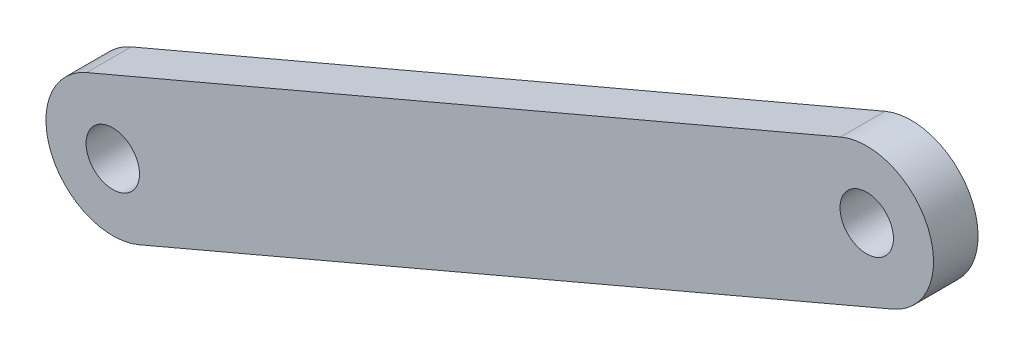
ISO-10303-21;
HEADER;
FILE_DESCRIPTION(('STEP AP214'),'2;1');
FILE_NAME('part.step','',(''),(''),'','','');
FILE_SCHEMA(('AUTOMOTIVE_DESIGN { 1 0 10303 214 1 1 1 1 }'));
ENDSEC;
DATA;
#1=APPLICATION_CONTEXT('core data for automotive mechanical design processes');
#2=APPLICATION_PROTOCOL_DEFINITION('international standard','automotive_design',2000,#1);
#3=PRODUCT_CONTEXT('',#1,'mechanical');
#4=PRODUCT('Part','Part','',(#3));
#5=PRODUCT_RELATED_PRODUCT_CATEGORY('part','',(#4));
#6=PRODUCT_DEFINITION_FORMATION('','',#4);
#7=PRODUCT_DEFINITION_CONTEXT('part definition',#1,'design');
#8=PRODUCT_DEFINITION('design','',#6,#7);
#9=PRODUCT_DEFINITION_SHAPE('','',#8);
#10=(LENGTH_UNIT() NAMED_UNIT(*) SI_UNIT(.MILLI.,.METRE.));
#11=(NAMED_UNIT(*) PLANE_ANGLE_UNIT() SI_UNIT($,.RADIAN.));
#12=(NAMED_UNIT(*) SI_UNIT($,.STERADIAN.) SOLID_ANGLE_UNIT());
#13=UNCERTAINTY_MEASURE_WITH_UNIT(LENGTH_MEASURE(1.E-05),#10,'distance_accuracy_value','');
#14=(GEOMETRIC_REPRESENTATION_CONTEXT(3) GLOBAL_UNCERTAINTY_ASSIGNED_CONTEXT((#13)) GLOBAL_UNIT_ASSIGNED_CONTEXT((#10,
#11,#12)) REPRESENTATION_CONTEXT('',''));
#15=CARTESIAN_POINT('',(0.,0.,0.));
#16=DIRECTION('',(0.,0.,1.));
#17=DIRECTION('',(1.,0.,0.));
#18=AXIS2_PLACEMENT_3D('',#15,#16,#17);
#19=CARTESIAN_POINT('',(0.,-20.,-5.));
#20=DIRECTION('',(0.,0.,-1.));
#21=DIRECTION('',(-1.,0.,0.));
#22=AXIS2_PLACEMENT_3D('',#19,#20,#21);
#23=CYLINDRICAL_SURFACE('',#22,7.50000000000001);
#24=CARTESIAN_POINT('',(0.,-20.,-10.));
#25=DIRECTION('',(0.,0.,1.));
#26=DIRECTION('',(1.,0.,0.));
#27=AXIS2_PLACEMENT_3D('',#24,#25,#26);
#28=CIRCLE('',#27,7.50000000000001);
#29=CARTESIAN_POINT('',(2.93949354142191,-26.8999549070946,-10.));
#30=VERTEX_POINT('',#29);
#31=CARTESIAN_POINT('',(-2.9394935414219,-13.1000450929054,-10.));
#32=VERTEX_POINT('',#31);
#33=EDGE_CURVE('E100',#30,#32,#28,.T.);
#34=ORIENTED_EDGE('',*,*,#33,.T.);
#35=DIRECTION('',(0.,0.,-1.));
#36=VECTOR('',#35,1.);
#37=CARTESIAN_POINT('',(-2.9394935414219,-13.1000450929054,-5.));
#38=LINE('',#37,#36);
#39=CARTESIAN_POINT('',(-2.9394935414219,-13.1000450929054,-5.));
#40=VERTEX_POINT('',#39);
#41=EDGE_CURVE('E11',#40,#32,#38,.T.);
#42=ORIENTED_EDGE('',*,*,#41,.F.);
#43=CARTESIAN_POINT('',(0.,-20.,-5.));
#44=DIRECTION('',(0.,0.,1.));
#45=DIRECTION('',(1.,0.,0.));
#46=AXIS2_PLACEMENT_3D('',#43,#44,#45);
#47=CIRCLE('',#46,7.50000000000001);
#48=CARTESIAN_POINT('',(2.93949354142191,-26.8999549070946,-5.));
#49=VERTEX_POINT('',#48);
#50=EDGE_CURVE('E88',#49,#40,#47,.T.);
#51=ORIENTED_EDGE('',*,*,#50,.F.);
#52=DIRECTION('',(0.,0.,-1.));
#53=VECTOR('',#52,1.);
#54=CARTESIAN_POINT('',(2.93949354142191,-26.8999549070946,-5.));
#55=LINE('',#54,#53);
#56=EDGE_CURVE('E96',#49,#30,#55,.T.);
#57=ORIENTED_EDGE('',*,*,#56,.T.);
#58=EDGE_LOOP('',(#34,#42,#51,#57));
#59=FACE_BOUND('',#58,.T.);
#60=ADVANCED_FACE('F37',(#59),#23,.T.);
#61=CARTESIAN_POINT('',(-2.9394935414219,-13.1000450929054,-5.));
#62=DIRECTION('',(0.391932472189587,-0.919993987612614,0.));
#63=DIRECTION('',(0.919993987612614,0.391932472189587,0.));
#64=AXIS2_PLACEMENT_3D('',#61,#62,#63);
#65=PLANE('',#64);
#66=DIRECTION('',(-0.919993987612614,-0.391932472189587,0.));
#67=VECTOR('',#66,1.);
#68=CARTESIAN_POINT('',(-2.9394935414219,-13.1000450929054,-10.));
#69=LINE('',#68,#67);
#70=CARTESIAN_POINT('',(-87.5789404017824,-49.1578325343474,-10.));
#71=VERTEX_POINT('',#70);
#72=EDGE_CURVE('E92',#32,#71,#69,.T.);
#73=ORIENTED_EDGE('',*,*,#72,.T.);
#74=DIRECTION('',(0.,0.,-1.));
#75=VECTOR('',#74,1.);
#76=CARTESIAN_POINT('',(-87.5789404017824,-49.1578325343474,-5.));
#77=LINE('',#76,#75);
#78=CARTESIAN_POINT('',(-87.5789404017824,-49.1578325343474,-5.));
#79=VERTEX_POINT('',#78);
#80=EDGE_CURVE('E45',#79,#71,#77,.T.);
#81=ORIENTED_EDGE('',*,*,#80,.F.);
#82=DIRECTION('',(-0.919993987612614,-0.391932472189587,0.));
#83=VECTOR('',#82,1.);
#84=CARTESIAN_POINT('',(-2.9394935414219,-13.1000450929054,-5.));
#85=LINE('',#84,#83);
#86=EDGE_CURVE('E83',#40,#79,#85,.T.);
#87=ORIENTED_EDGE('',*,*,#86,.F.);
#88=ORIENTED_EDGE('',*,*,#41,.T.);
#89=EDGE_LOOP('',(#73,#81,#87,#88));
#90=FACE_BOUND('',#89,.T.);
#91=ADVANCED_FACE('F91',(#90),#65,.F.);
#92=CARTESIAN_POINT('',(-84.6394468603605,-56.057787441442,-5.));
#93=DIRECTION('',(0.,0.,-1.));
#94=DIRECTION('',(-1.,0.,0.));
#95=AXIS2_PLACEMENT_3D('',#92,#93,#94);
#96=CYLINDRICAL_SURFACE('',#95,7.50000000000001);
#97=CARTESIAN_POINT('',(-84.6394468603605,-56.057787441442,-10.));
#98=DIRECTION('',(0.,0.,1.));
#99=DIRECTION('',(1.,0.,0.));
#100=AXIS2_PLACEMENT_3D('',#97,#98,#99);
#101=CIRCLE('',#100,7.50000000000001);
#102=CARTESIAN_POINT('',(-81.6999533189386,-62.9577423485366,-10.));
#103=VERTEX_POINT('',#102);
#104=EDGE_CURVE('E70',#71,#103,#101,.T.);
#105=ORIENTED_EDGE('',*,*,#104,.T.);
#106=DIRECTION('',(0.,0.,-1.));
#107=VECTOR('',#106,1.);
#108=CARTESIAN_POINT('',(-81.6999533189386,-62.9577423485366,-5.));
#109=LINE('',#108,#107);
#110=CARTESIAN_POINT('',(-81.6999533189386,-62.9577423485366,-5.));
#111=VERTEX_POINT('',#110);
#112=EDGE_CURVE('E93',#111,#103,#109,.T.);
#113=ORIENTED_EDGE('',*,*,#112,.F.);
#114=CARTESIAN_POINT('',(-84.6394468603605,-56.057787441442,-5.));
#115=DIRECTION('',(0.,0.,1.));
#116=DIRECTION('',(1.,0.,0.));
#117=AXIS2_PLACEMENT_3D('',#114,#115,#116);
#118=CIRCLE('',#117,7.50000000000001);
#119=EDGE_CURVE('E86',#79,#111,#118,.T.);
#120=ORIENTED_EDGE('',*,*,#119,.F.);
#121=ORIENTED_EDGE('',*,*,#80,.T.);
#122=EDGE_LOOP('',(#105,#113,#120,#121));
#123=FACE_BOUND('',#122,.T.);
#124=ADVANCED_FACE('F94',(#123),#96,.T.);
#125=CARTESIAN_POINT('',(2.93949354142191,-26.8999549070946,-5.));
#126=DIRECTION('',(-0.391932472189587,0.919993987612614,0.));
#127=DIRECTION('',(-0.919993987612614,-0.391932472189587,0.));
#128=AXIS2_PLACEMENT_3D('',#125,#126,#127);
#129=PLANE('',#128);
#130=DIRECTION('',(0.919993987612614,0.391932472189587,0.));
#131=VECTOR('',#130,1.);
#132=CARTESIAN_POINT('',(2.93949354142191,-26.8999549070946,-10.));
#133=LINE('',#132,#131);
#134=EDGE_CURVE('E76',#103,#30,#133,.T.);
#135=ORIENTED_EDGE('',*,*,#134,.T.);
#136=ORIENTED_EDGE('',*,*,#56,.F.);
#137=DIRECTION('',(0.919993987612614,0.391932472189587,0.));
#138=VECTOR('',#137,1.);
#139=CARTESIAN_POINT('',(2.93949354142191,-26.8999549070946,-5.));
#140=LINE('',#139,#138);
#141=EDGE_CURVE('E53',#111,#49,#140,.T.);
#142=ORIENTED_EDGE('',*,*,#141,.F.);
#143=ORIENTED_EDGE('',*,*,#112,.T.);
#144=EDGE_LOOP('',(#135,#136,#142,#143));
#145=FACE_BOUND('',#144,.T.);
#146=ADVANCED_FACE('F108',(#145),#129,.F.);
#147=CARTESIAN_POINT('',(0.,-20.,-5.));
#148=DIRECTION('',(0.,0.,1.));
#149=DIRECTION('',(1.,0.,0.));
#150=AXIS2_PLACEMENT_3D('',#147,#148,#149);
#151=PLANE('',#150);
#152=CARTESIAN_POINT('',(-84.6394468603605,-56.057787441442,-5.));
#153=DIRECTION('',(0.,0.,1.));
#154=DIRECTION('',(1.,0.,0.));
#155=AXIS2_PLACEMENT_3D('',#152,#153,#154);
#156=CIRCLE('',#155,3.00000000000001);
#157=CARTESIAN_POINT('',(-81.6394468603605,-56.057787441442,-5.));
#158=VERTEX_POINT('',#157);
#159=EDGE_CURVE('E120',#158,#158,#156,.T.);
#160=ORIENTED_EDGE('',*,*,#159,.F.);
#161=EDGE_LOOP('',(#160));
#162=FACE_BOUND('',#161,.T.);
#163=CARTESIAN_POINT('',(0.,-20.,-5.));
#164=DIRECTION('',(0.,0.,1.));
#165=DIRECTION('',(1.,0.,0.));
#166=AXIS2_PLACEMENT_3D('',#163,#164,#165);
#167=CIRCLE('',#166,3.);
#168=CARTESIAN_POINT('',(3.,-20.,-5.));
#169=VERTEX_POINT('',#168);
#170=EDGE_CURVE('E117',#169,#169,#167,.T.);
#171=ORIENTED_EDGE('',*,*,#170,.F.);
#172=EDGE_LOOP('',(#171));
#173=FACE_BOUND('',#172,.T.);
#174=ORIENTED_EDGE('',*,*,#50,.T.);
#175=ORIENTED_EDGE('',*,*,#86,.T.);
#176=ORIENTED_EDGE('',*,*,#119,.T.);
#177=ORIENTED_EDGE('',*,*,#141,.T.);
#178=EDGE_LOOP('',(#174,#175,#176,#177));
#179=FACE_BOUND('',#178,.T.);
#180=ADVANCED_FACE('F84',(#162,#173,#179),#151,.T.);
#181=CARTESIAN_POINT('',(0.,-20.,-10.));
#182=DIRECTION('',(0.,0.,1.));
#183=DIRECTION('',(1.,0.,0.));
#184=AXIS2_PLACEMENT_3D('',#181,#182,#183);
#185=PLANE('',#184);
#186=CARTESIAN_POINT('',(-84.6394468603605,-56.057787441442,-10.));
#187=DIRECTION('',(0.,0.,1.));
#188=DIRECTION('',(1.,0.,0.));
#189=AXIS2_PLACEMENT_3D('',#186,#187,#188);
#190=CIRCLE('',#189,3.00000000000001);
#191=CARTESIAN_POINT('',(-81.6394468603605,-56.057787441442,-10.));
#192=VERTEX_POINT('',#191);
#193=EDGE_CURVE('E103',#192,#192,#190,.T.);
#194=ORIENTED_EDGE('',*,*,#193,.T.);
#195=EDGE_LOOP('',(#194));
#196=FACE_BOUND('',#195,.T.);
#197=CARTESIAN_POINT('',(0.,-20.,-10.));
#198=DIRECTION('',(0.,0.,1.));
#199=DIRECTION('',(1.,0.,0.));
#200=AXIS2_PLACEMENT_3D('',#197,#198,#199);
#201=CIRCLE('',#200,3.);
#202=CARTESIAN_POINT('',(3.,-20.,-10.));
#203=VERTEX_POINT('',#202);
#204=EDGE_CURVE('E114',#203,#203,#201,.T.);
#205=ORIENTED_EDGE('',*,*,#204,.T.);
#206=EDGE_LOOP('',(#205));
#207=FACE_BOUND('',#206,.T.);
#208=ORIENTED_EDGE('',*,*,#33,.F.);
#209=ORIENTED_EDGE('',*,*,#134,.F.);
#210=ORIENTED_EDGE('',*,*,#104,.F.);
#211=ORIENTED_EDGE('',*,*,#72,.F.);
#212=EDGE_LOOP('',(#208,#209,#210,#211));
#213=FACE_BOUND('',#212,.T.);
#214=ADVANCED_FACE('F111',(#196,#207,#213),#185,.F.);
#215=CARTESIAN_POINT('',(0.,-20.,-10.));
#216=DIRECTION('',(0.,0.,1.));
#217=DIRECTION('',(1.,0.,0.));
#218=AXIS2_PLACEMENT_3D('',#215,#216,#217);
#219=CYLINDRICAL_SURFACE('',#218,3.);
#220=ORIENTED_EDGE('',*,*,#204,.F.);
#221=EDGE_LOOP('',(#220));
#222=FACE_BOUND('',#221,.T.);
#223=ORIENTED_EDGE('',*,*,#170,.T.);
#224=EDGE_LOOP('',(#223));
#225=FACE_BOUND('',#224,.T.);
#226=ADVANCED_FACE('F131',(#222,#225),#219,.F.);
#227=CARTESIAN_POINT('',(-84.6394468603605,-56.057787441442,-10.));
#228=DIRECTION('',(0.,0.,1.));
#229=DIRECTION('',(1.,0.,0.));
#230=AXIS2_PLACEMENT_3D('',#227,#228,#229);
#231=CYLINDRICAL_SURFACE('',#230,3.00000000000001);
#232=ORIENTED_EDGE('',*,*,#193,.F.);
#233=EDGE_LOOP('',(#232));
#234=FACE_BOUND('',#233,.T.);
#235=ORIENTED_EDGE('',*,*,#159,.T.);
#236=EDGE_LOOP('',(#235));
#237=FACE_BOUND('',#236,.T.);
#238=ADVANCED_FACE('F128',(#234,#237),#231,.F.);
#239=CLOSED_SHELL('',(#60,#91,#124,#146,#180,#214,#226,#238));
#240=MANIFOLD_SOLID_BREP('B2',#239);
#241=ADVANCED_BREP_SHAPE_REPRESENTATION('',(#18,#240),#14);
#242=SHAPE_DEFINITION_REPRESENTATION(#9,#241);
ENDSEC;
END-ISO-10303-21;
